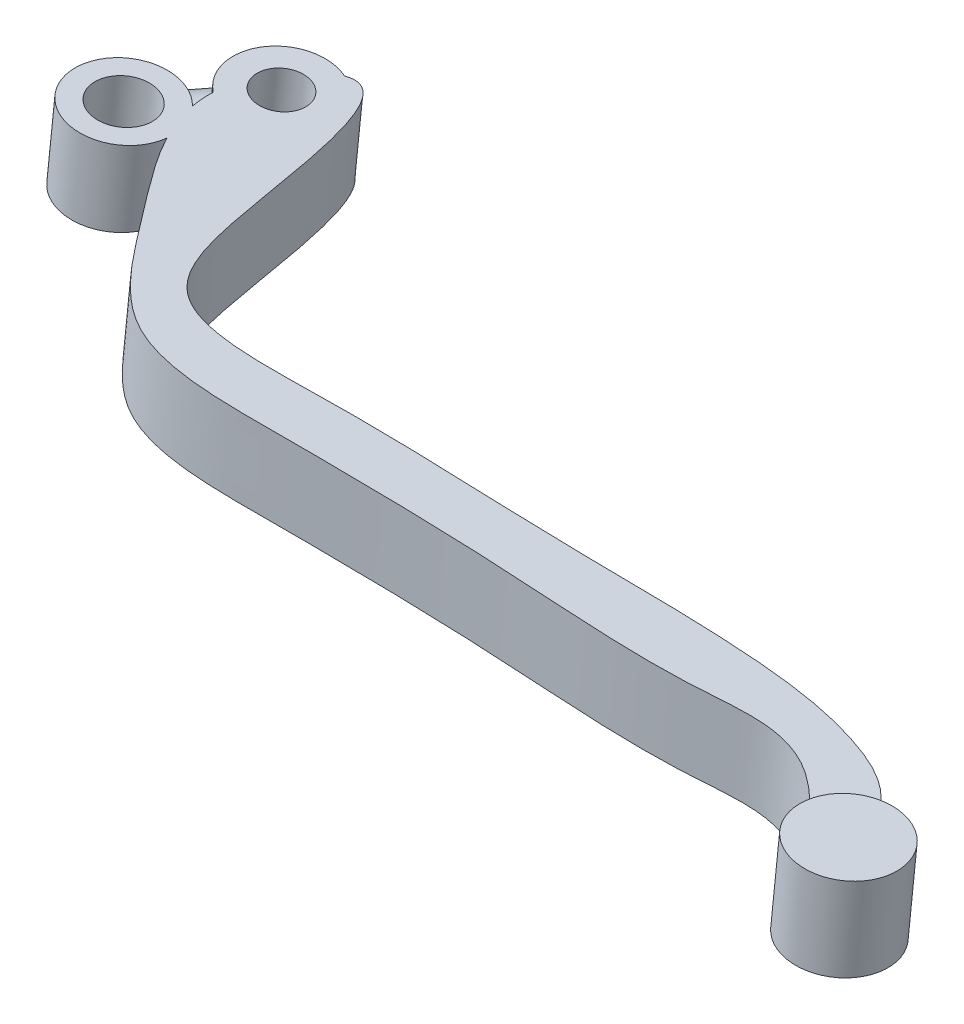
from build123d import *

# Parameters (mm, degrees)
PALANCA_DEPTH                 = 4.5
BUJE_PIVOTE_PROFILE_R         = 5.5
BOLA_PROFILE_R                = 5.5
BRAZO_CABEZAL_PROFILE_R       = 4
OREJA_CABEZAL_PROFILE_R       = 5.5
AGUJERO_PIVOTE_PROFILE_R      = 2.75
ALOJAMIENTO_CABEZAL_PROFILE_R = 3.25
SALIDA_CABLE_PROFILE_R        = 1


with BuildPart() as part:
    # Sk_Palanca → Palanca (new, symmetric)
    with BuildSketch(Plane(origin=(6.614764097, 64.837786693, 0), x_dir=(-0.994836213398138, 0.10149339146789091, 0), z_dir=(-0.1014933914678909, -0.9948362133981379, 0))):
        with BuildLine():
            add(Edge.make_bspline(
                [(-246.267712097, -9.635902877), (-243.886968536, -16.428336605), (-252.167229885, -26.539110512), (-262.150904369, -40.917249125), (-282.597733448, -38.61306643), (-302.067834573, -36.912429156), (-321.774042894, -36.730768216), (-335.8922068, -32.77279684), (-346.42741419, -47.422354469), (-345.126178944, -34.200079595), (-335.600297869, -29.860646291), (-321.07478475, -29.32902891), (-301.354059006, -31.612602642), (-282.725652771, -32.142864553), (-261.071507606, -35.64669483), (-257.235825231, -19.931179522), (-254.911764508, 3.376830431), (-247.263524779, -6.794777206), (-246.267712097, -9.635902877)],
                knots=[0, 0, 0, 0, 0.078945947, 0.135623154, 0.200778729, 0.301383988, 0.381877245, 0.435139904, 0.476711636, 0.50085207, 0.542423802, 0.595686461, 0.676179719, 0.776784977, 0.841940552, 0.8880327, 0.966978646, 1, 1, 1, 1], degree=3))
        make_face()
    extrude(amount=PALANCA_DEPTH, both=True)

    # Buje_pivote: sweep along a curve in space
    with BuildLine() as buje_pivote_path:
        Line((253.82871512, 35.093611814, 8.366303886), (254.742155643, 44.047137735, 8.366303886))
    # Buje_pivote profile (on start of the path) → Buje_pivote (sweep)
    with BuildSketch(Plane(origin=(253.82871512, 35.093611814, 8.366303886), x_dir=(0.9948362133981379, -0.10149339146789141, 0), z_dir=(0.10149339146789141, 0.9948362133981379, 0))):
        Circle(BUJE_PIVOTE_PROFILE_R)
    sweep(path=buje_pivote_path.line)

    # Bola: sweep along a curve in space
    with BuildLine() as bola_path:
        Line((349.354760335, 24.845430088, 40.103497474), (350.369694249, 34.793792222, 40.103497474))
    # Bola profile (on start of the path) → Bola (sweep)
    with BuildSketch(Plane(origin=(349.354760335, 24.845430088, 40.103497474), x_dir=(0.9948362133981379, -0.101493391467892, 0), z_dir=(0.101493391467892, 0.9948362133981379, 0))):
        Circle(BOLA_PROFILE_R)
    sweep(path=bola_path.line)

    # Brazo_cabezal: sweep along a curve in space
    with BuildLine() as brazo_cabezal_path:
        Line((254.285435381, 39.570374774, 8.366303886), (247.241040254, 40.289045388, 19.112001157))
    # Brazo_cabezal profile (on start of the path) → Brazo_cabezal (sweep)
    with BuildSketch(Plane(origin=(254.285435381, 39.570374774, 8.366303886), x_dir=(0.8363144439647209, 0, 0.5482500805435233), z_dir=(-0.5473944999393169, 0.05584529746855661, 0.835009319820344))):
        Circle(BRAZO_CABEZAL_PROFILE_R)
    sweep(path=brazo_cabezal_path.line)

    # Oreja_cabezal: sweep along a curve in space
    with BuildLine() as oreja_cabezal_path:
        Line((246.784319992, 35.812282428, 19.112001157), (247.697760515, 44.765808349, 19.112001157))
    # Oreja_cabezal profile (on start of the path) → Oreja_cabezal (sweep)
    with BuildSketch(Plane(origin=(246.784319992, 35.812282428, 19.112001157), x_dir=(0.9948362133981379, -0.10149339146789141, 0), z_dir=(0.10149339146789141, 0.9948362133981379, 0))):
        Circle(OREJA_CABEZAL_PROFILE_R)
    sweep(path=oreja_cabezal_path.line)

    # Agujero_pivote: sweep along a curve in space
    with BuildLine() as agujero_pivote_path:
        Line((253.473488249, 31.611685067, 8.366303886), (255.097382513, 47.529064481, 8.366303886))
    # Agujero_pivote profile (on start of the path) → Agujero_pivote (sweep, cut)
    with BuildSketch(Plane(origin=(253.473488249, 31.611685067, 8.366303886), x_dir=(0.9948362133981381, -0.10149339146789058, 0), z_dir=(0.10149339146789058, 0.9948362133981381, 0))):
        Circle(AGUJERO_PIVOTE_PROFILE_R)
    sweep(path=agujero_pivote_path.line, mode=Mode.SUBTRACT)

    # Alojamiento_cabezal: sweep along a curve in space
    with BuildLine() as alojamiento_cabezal_path:
        Line((246.632079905, 34.320028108, 19.112001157), (247.850000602, 46.258062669, 19.112001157))
    # Alojamiento_cabezal profile (on start of the path) → Alojamiento_cabezal (sweep, cut)
    with BuildSketch(Plane(origin=(246.632079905, 34.320028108, 19.112001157), x_dir=(0.9948362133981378, -0.10149339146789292, 0), z_dir=(0.10149339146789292, 0.9948362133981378, 0))):
        Circle(ALOJAMIENTO_CABEZAL_PROFILE_R)
    sweep(path=alojamiento_cabezal_path.line, mode=Mode.SUBTRACT)

    # Salida_cable: sweep along a curve in space
    with BuildLine() as salida_cable_path:
        Line((247.241040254, 40.289045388, 19.112001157), (238.545113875, 41.176205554, 22.183452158))
    # Salida_cable profile (on start of the path) → Salida_cable (sweep, cut)
    with BuildSketch(Plane(origin=(247.241040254, 40.289045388, 19.112001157), x_dir=(-0.3330419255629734, 0, -0.9429120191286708), z_dir=(-0.9385793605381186, 0.09575405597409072, 0.33151160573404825))):
        Circle(SALIDA_CABLE_PROFILE_R)
    sweep(path=salida_cable_path.line, mode=Mode.SUBTRACT)


solid = part.part
